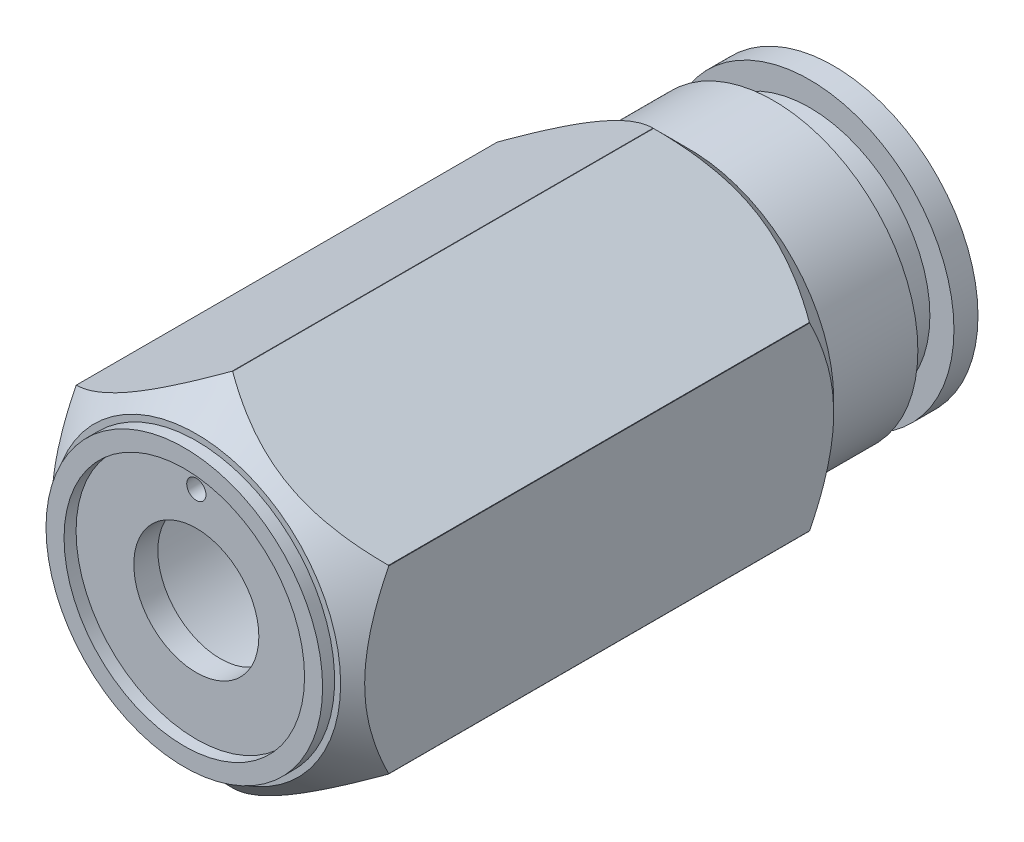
ISO-10303-21;
HEADER;
FILE_DESCRIPTION(('STEP AP214'),'2;1');
FILE_NAME('part.step','',(''),(''),'','','');
FILE_SCHEMA(('AUTOMOTIVE_DESIGN { 1 0 10303 214 1 1 1 1 }'));
ENDSEC;
DATA;
#1=APPLICATION_CONTEXT('core data for automotive mechanical design processes');
#2=APPLICATION_PROTOCOL_DEFINITION('international standard','automotive_design',2000,#1);
#3=PRODUCT_CONTEXT('',#1,'mechanical');
#4=PRODUCT('Part','Part','',(#3));
#5=PRODUCT_RELATED_PRODUCT_CATEGORY('part','',(#4));
#6=PRODUCT_DEFINITION_FORMATION('','',#4);
#7=PRODUCT_DEFINITION_CONTEXT('part definition',#1,'design');
#8=PRODUCT_DEFINITION('design','',#6,#7);
#9=PRODUCT_DEFINITION_SHAPE('','',#8);
#10=(LENGTH_UNIT() NAMED_UNIT(*) SI_UNIT(.MILLI.,.METRE.));
#11=(NAMED_UNIT(*) PLANE_ANGLE_UNIT() SI_UNIT($,.RADIAN.));
#12=(NAMED_UNIT(*) SI_UNIT($,.STERADIAN.) SOLID_ANGLE_UNIT());
#13=UNCERTAINTY_MEASURE_WITH_UNIT(LENGTH_MEASURE(1.E-05),#10,'distance_accuracy_value','');
#14=(GEOMETRIC_REPRESENTATION_CONTEXT(3) GLOBAL_UNCERTAINTY_ASSIGNED_CONTEXT((#13)) GLOBAL_UNIT_ASSIGNED_CONTEXT((#10,
#11,#12)) REPRESENTATION_CONTEXT('',''));
#15=CARTESIAN_POINT('',(0.,0.,0.));
#16=DIRECTION('',(0.,0.,1.));
#17=DIRECTION('',(1.,0.,0.));
#18=AXIS2_PLACEMENT_3D('',#15,#16,#17);
#19=CARTESIAN_POINT('',(0.,6.,-6.));
#20=DIRECTION('',(0.,0.,1.));
#21=DIRECTION('',(1.,0.,0.));
#22=AXIS2_PLACEMENT_3D('',#19,#20,#21);
#23=PLANE('',#22);
#24=CARTESIAN_POINT('',(0.,0.,-6.));
#25=DIRECTION('',(0.,0.,-1.));
#26=DIRECTION('',(-1.,0.,0.));
#27=AXIS2_PLACEMENT_3D('',#24,#25,#26);
#28=CIRCLE('',#27,2.5);
#29=CARTESIAN_POINT('',(-2.5,0.,-6.));
#30=VERTEX_POINT('',#29);
#31=EDGE_CURVE('E282',#30,#30,#28,.T.);
#32=ORIENTED_EDGE('',*,*,#31,.F.);
#33=EDGE_LOOP('',(#32));
#34=FACE_BOUND('',#33,.T.);
#35=CARTESIAN_POINT('',(0.,0.,-6.));
#36=DIRECTION('',(0.,0.,1.));
#37=DIRECTION('',(1.,0.,0.));
#38=AXIS2_PLACEMENT_3D('',#35,#36,#37);
#39=CIRCLE('',#38,6.);
#40=CARTESIAN_POINT('',(-6.,0.,-6.));
#41=VERTEX_POINT('',#40);
#42=EDGE_CURVE('E297',#41,#41,#39,.T.);
#43=ORIENTED_EDGE('',*,*,#42,.F.);
#44=EDGE_LOOP('',(#43));
#45=FACE_BOUND('',#44,.T.);
#46=ADVANCED_FACE('F16',(#34,#45),#23,.F.);
#47=CARTESIAN_POINT('',(0.,5.,-5.));
#48=DIRECTION('',(0.,0.,-1.));
#49=DIRECTION('',(0.,-1.,0.));
#50=AXIS2_PLACEMENT_3D('',#47,#48,#49);
#51=PLANE('',#50);
#52=CARTESIAN_POINT('',(0.,0.,-5.));
#53=DIRECTION('',(0.,0.,1.));
#54=DIRECTION('',(1.,0.,0.));
#55=AXIS2_PLACEMENT_3D('',#52,#53,#54);
#56=CIRCLE('',#55,5.);
#57=CARTESIAN_POINT('',(-5.,0.,-5.));
#58=VERTEX_POINT('',#57);
#59=EDGE_CURVE('E283',#58,#58,#56,.T.);
#60=ORIENTED_EDGE('',*,*,#59,.F.);
#61=EDGE_LOOP('',(#60));
#62=FACE_BOUND('',#61,.T.);
#63=CARTESIAN_POINT('',(0.,0.,-5.));
#64=DIRECTION('',(0.,0.,1.));
#65=DIRECTION('',(1.,0.,0.));
#66=AXIS2_PLACEMENT_3D('',#63,#64,#65);
#67=CIRCLE('',#66,6.);
#68=CARTESIAN_POINT('',(6.,0.,-5.));
#69=VERTEX_POINT('',#68);
#70=EDGE_CURVE('E286',#69,#69,#67,.T.);
#71=ORIENTED_EDGE('',*,*,#70,.T.);
#72=EDGE_LOOP('',(#71));
#73=FACE_BOUND('',#72,.T.);
#74=ADVANCED_FACE('F597',(#62,#73),#51,.F.);
#75=CARTESIAN_POINT('',(0.,6.,-3.5));
#76=DIRECTION('',(0.,0.,1.));
#77=DIRECTION('',(1.,0.,0.));
#78=AXIS2_PLACEMENT_3D('',#75,#76,#77);
#79=PLANE('',#78);
#80=CARTESIAN_POINT('',(0.,0.,-3.5));
#81=DIRECTION('',(0.,0.,1.));
#82=DIRECTION('',(1.,0.,0.));
#83=AXIS2_PLACEMENT_3D('',#80,#81,#82);
#84=CIRCLE('',#83,5.);
#85=CARTESIAN_POINT('',(5.,0.,-3.5));
#86=VERTEX_POINT('',#85);
#87=EDGE_CURVE('E252',#86,#86,#84,.T.);
#88=ORIENTED_EDGE('',*,*,#87,.T.);
#89=EDGE_LOOP('',(#88));
#90=FACE_BOUND('',#89,.T.);
#91=CARTESIAN_POINT('',(0.,0.,-3.5));
#92=DIRECTION('',(0.,0.,1.));
#93=DIRECTION('',(1.,0.,0.));
#94=AXIS2_PLACEMENT_3D('',#91,#92,#93);
#95=CIRCLE('',#94,6.);
#96=CARTESIAN_POINT('',(-6.,0.,-3.5));
#97=VERTEX_POINT('',#96);
#98=EDGE_CURVE('E242',#97,#97,#95,.T.);
#99=ORIENTED_EDGE('',*,*,#98,.F.);
#100=EDGE_LOOP('',(#99));
#101=FACE_BOUND('',#100,.T.);
#102=ADVANCED_FACE('F592',(#90,#101),#79,.F.);
#103=CARTESIAN_POINT('',(0.,-7.50555349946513,20.5));
#104=DIRECTION('',(0.5,0.866025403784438,0.));
#105=DIRECTION('',(0.,0.,-1.));
#106=AXIS2_PLACEMENT_3D('',#103,#104,#105);
#107=PLANE('',#106);
#108=CARTESIAN_POINT('',(-0.0096296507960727,-7.49999381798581,19.));
#109=CARTESIAN_POINT('',(-0.828912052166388,-7.02698090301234,19.4719606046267));
#110=CARTESIAN_POINT('',(-1.57034631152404,-6.59891363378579,19.7168113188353));
#111=CARTESIAN_POINT('',(-2.4215834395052,-6.10745164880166,19.9979232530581));
#112=CARTESIAN_POINT('',(-3.23817168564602,-5.63599420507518,19.9999856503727));
#113=CARTESIAN_POINT('',(-4.05526989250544,-5.16424233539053,20.002049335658));
#114=CARTESIAN_POINT('',(-4.90801836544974,-4.67190777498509,19.7239121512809));
#115=CARTESIAN_POINT('',(-5.65882494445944,-4.2384293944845,19.4790249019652));
#116=CARTESIAN_POINT('',(-6.49037034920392,-3.75833643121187,19.));
#117=B_SPLINE_CURVE_WITH_KNOTS('',2,(#108,#109,#110,#111,#112,#113,#114,#115,#116),
.UNSPECIFIED.,.F.,.F.,(3,2,2,2,3),(0.,0.25,0.5,0.75,1.),.UNSPECIFIED.);
#118=CARTESIAN_POINT('',(-0.0096296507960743,-7.49999381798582,19.));
#119=VERTEX_POINT('',#118);
#120=CARTESIAN_POINT('',(-6.49037034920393,-3.75833643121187,19.));
#121=VERTEX_POINT('',#120);
#122=EDGE_CURVE('E478',#119,#121,#117,.T.);
#123=ORIENTED_EDGE('',*,*,#122,.T.);
#124=DIRECTION('',(0.,0.,1.));
#125=VECTOR('',#124,1.);
#126=CARTESIAN_POINT('',(-6.49037034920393,-3.75833643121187,20.5));
#127=LINE('',#126,#125);
#128=CARTESIAN_POINT('',(-6.49037034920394,-3.75833643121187,1.5));
#129=VERTEX_POINT('',#128);
#130=EDGE_CURVE('E10',#129,#121,#127,.T.);
#131=ORIENTED_EDGE('',*,*,#130,.F.);
#132=CARTESIAN_POINT('',(-6.49037034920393,-3.75833643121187,1.5));
#133=CARTESIAN_POINT('',(-5.67108794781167,-4.23134934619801,1.0280393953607));
#134=CARTESIAN_POINT('',(-4.92965368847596,-4.6594166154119,0.783188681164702));
#135=CARTESIAN_POINT('',(-4.078416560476,-5.15087860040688,0.502076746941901));
#136=CARTESIAN_POINT('',(-3.26182831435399,-5.62233604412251,0.500014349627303));
#137=CARTESIAN_POINT('',(-2.4447301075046,-6.09408791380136,0.497950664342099));
#138=CARTESIAN_POINT('',(-1.59198163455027,-6.58642247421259,0.776087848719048));
#139=CARTESIAN_POINT('',(-0.841175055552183,-7.01990085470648,1.02097509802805));
#140=CARTESIAN_POINT('',(-0.00962965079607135,-7.49999381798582,1.5));
#141=B_SPLINE_CURVE_WITH_KNOTS('',2,(#132,#133,#134,#135,#136,#137,#138,#139,#140),
.UNSPECIFIED.,.F.,.F.,(3,2,2,2,3),(0.,0.25,0.5,0.75,1.),.UNSPECIFIED.);
#142=CARTESIAN_POINT('',(-0.00962965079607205,-7.49999381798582,1.5));
#143=VERTEX_POINT('',#142);
#144=EDGE_CURVE('E534',#129,#143,#141,.T.);
#145=ORIENTED_EDGE('',*,*,#144,.T.);
#146=DIRECTION('',(0.,0.,-1.));
#147=VECTOR('',#146,1.);
#148=CARTESIAN_POINT('',(-0.0096296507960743,-7.49999381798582,20.5));
#149=LINE('',#148,#147);
#150=EDGE_CURVE('E304',#119,#143,#149,.T.);
#151=ORIENTED_EDGE('',*,*,#150,.F.);
#152=EDGE_LOOP('',(#123,#131,#145,#151));
#153=FACE_BOUND('',#152,.T.);
#154=ADVANCED_FACE('F596',(#153),#107,.F.);
#155=CARTESIAN_POINT('',(0.,0.,20.5));
#156=DIRECTION('',(0.,0.,-1.));
#157=DIRECTION('',(-1.,0.,0.));
#158=AXIS2_PLACEMENT_3D('',#155,#156,#157);
#159=CYLINDRICAL_SURFACE('',#158,7.5);
#160=CARTESIAN_POINT('',(0.,0.,1.5));
#161=DIRECTION('',(0.,0.,1.));
#162=DIRECTION('',(1.,0.,0.));
#163=AXIS2_PLACEMENT_3D('',#160,#161,#162);
#164=CIRCLE('',#163,7.5);
#165=CARTESIAN_POINT('',(-6.5,-3.74165738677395,1.5));
#166=VERTEX_POINT('',#165);
#167=EDGE_CURVE('E538',#166,#129,#164,.T.);
#168=ORIENTED_EDGE('',*,*,#167,.T.);
#169=ORIENTED_EDGE('',*,*,#130,.T.);
#170=CARTESIAN_POINT('',(0.,0.,19.));
#171=DIRECTION('',(0.,0.,-1.));
#172=DIRECTION('',(1.,0.,0.));
#173=AXIS2_PLACEMENT_3D('',#170,#171,#172);
#174=CIRCLE('',#173,7.5);
#175=CARTESIAN_POINT('',(-6.5,-3.74165738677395,19.));
#176=VERTEX_POINT('',#175);
#177=EDGE_CURVE('E482',#121,#176,#174,.T.);
#178=ORIENTED_EDGE('',*,*,#177,.T.);
#179=DIRECTION('',(0.,0.,-1.));
#180=VECTOR('',#179,1.);
#181=CARTESIAN_POINT('',(-6.5,-3.74165738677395,20.5));
#182=LINE('',#181,#180);
#183=EDGE_CURVE('E29',#176,#166,#182,.T.);
#184=ORIENTED_EDGE('',*,*,#183,.T.);
#185=EDGE_LOOP('',(#168,#169,#178,#184));
#186=FACE_BOUND('',#185,.T.);
#187=ADVANCED_FACE('F639',(#186),#159,.T.);
#188=CARTESIAN_POINT('',(-6.5,-3.75277674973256,20.5));
#189=DIRECTION('',(1.,0.,0.));
#190=DIRECTION('',(0.,1.,0.));
#191=AXIS2_PLACEMENT_3D('',#188,#189,#190);
#192=PLANE('',#191);
#193=CARTESIAN_POINT('',(-6.5,-3.74165738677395,19.));
#194=CARTESIAN_POINT('',(-6.5,-2.78837203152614,19.4755822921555));
#195=CARTESIAN_POINT('',(-6.5,-1.92613583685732,19.7206195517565));
#196=CARTESIAN_POINT('',(-6.5,-0.943052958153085,20.));
#197=CARTESIAN_POINT('',(-6.5,0.,20.));
#198=B_SPLINE_CURVE_WITH_KNOTS('',2,(#193,#194,#195,#196,#197),.UNSPECIFIED.,.F.,.F.,(3,2,3),
(0.,0.5,1.),.UNSPECIFIED.);
#199=CARTESIAN_POINT('',(-6.5,0.,20.));
#200=VERTEX_POINT('',#199);
#201=EDGE_CURVE('E1085',#176,#200,#198,.T.);
#202=ORIENTED_EDGE('',*,*,#201,.T.);
#203=CARTESIAN_POINT('',(-6.5,0.,20.));
#204=CARTESIAN_POINT('',(-6.5,0.942559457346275,20.));
#205=CARTESIAN_POINT('',(-6.5,1.92613782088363,19.7206189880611));
#206=CARTESIAN_POINT('',(-6.5,2.78779977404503,19.4758677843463));
#207=CARTESIAN_POINT('',(-6.5,3.74165738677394,19.));
#208=B_SPLINE_CURVE_WITH_KNOTS('',2,(#203,#204,#205,#206,#207),.UNSPECIFIED.,.F.,.F.,(3,2,3),
(0.,0.5,1.),.UNSPECIFIED.);
#209=CARTESIAN_POINT('',(-6.5,3.74165738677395,19.));
#210=VERTEX_POINT('',#209);
#211=EDGE_CURVE('E275',#200,#210,#208,.T.);
#212=ORIENTED_EDGE('',*,*,#211,.T.);
#213=DIRECTION('',(0.,0.,1.));
#214=VECTOR('',#213,1.);
#215=CARTESIAN_POINT('',(-6.5,3.74165738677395,20.5));
#216=LINE('',#215,#214);
#217=CARTESIAN_POINT('',(-6.5,3.74165738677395,1.5));
#218=VERTEX_POINT('',#217);
#219=EDGE_CURVE('E490',#218,#210,#216,.T.);
#220=ORIENTED_EDGE('',*,*,#219,.F.);
#221=CARTESIAN_POINT('',(-6.5,3.74165738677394,1.5));
#222=CARTESIAN_POINT('',(-6.5,2.78837517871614,1.0244192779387));
#223=CARTESIAN_POINT('',(-6.5,1.92613782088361,0.779381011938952));
#224=CARTESIAN_POINT('',(-6.5,0.943055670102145,0.5));
#225=CARTESIAN_POINT('',(-6.5,0.,0.5));
#226=B_SPLINE_CURVE_WITH_KNOTS('',2,(#221,#222,#223,#224,#225),.UNSPECIFIED.,.F.,.F.,(3,2,3),
(0.,0.5,1.),.UNSPECIFIED.);
#227=CARTESIAN_POINT('',(-6.5,0.,0.5));
#228=VERTEX_POINT('',#227);
#229=EDGE_CURVE('E544',#218,#228,#226,.T.);
#230=ORIENTED_EDGE('',*,*,#229,.T.);
#231=CARTESIAN_POINT('',(-6.5,0.,0.5));
#232=CARTESIAN_POINT('',(-6.5,-0.942560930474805,0.5));
#233=CARTESIAN_POINT('',(-6.5,-1.92613583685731,0.779380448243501));
#234=CARTESIAN_POINT('',(-6.5,-2.78780147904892,1.024133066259));
#235=CARTESIAN_POINT('',(-6.5,-3.74165738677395,1.5));
#236=B_SPLINE_CURVE_WITH_KNOTS('',2,(#231,#232,#233,#234,#235),.UNSPECIFIED.,.F.,.F.,(3,2,3),
(0.,0.5,1.),.UNSPECIFIED.);
#237=EDGE_CURVE('E1051',#228,#166,#236,.T.);
#238=ORIENTED_EDGE('',*,*,#237,.T.);
#239=ORIENTED_EDGE('',*,*,#183,.F.);
#240=EDGE_LOOP('',(#202,#212,#220,#230,#238,#239));
#241=FACE_BOUND('',#240,.T.);
#242=ADVANCED_FACE('F643',(#241),#192,.F.);
#243=CARTESIAN_POINT('',(0.,0.,20.5));
#244=DIRECTION('',(0.,0.,-1.));
#245=DIRECTION('',(-1.,0.,0.));
#246=AXIS2_PLACEMENT_3D('',#243,#244,#245);
#247=CYLINDRICAL_SURFACE('',#246,7.5);
#248=CARTESIAN_POINT('',(0.,0.,19.));
#249=DIRECTION('',(0.,0.,-1.));
#250=DIRECTION('',(1.,0.,0.));
#251=AXIS2_PLACEMENT_3D('',#248,#249,#250);
#252=CIRCLE('',#251,7.5);
#253=CARTESIAN_POINT('',(-6.49037034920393,3.75833643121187,19.));
#254=VERTEX_POINT('',#253);
#255=EDGE_CURVE('E294',#210,#254,#252,.T.);
#256=ORIENTED_EDGE('',*,*,#255,.T.);
#257=DIRECTION('',(0.,0.,-1.));
#258=VECTOR('',#257,1.);
#259=CARTESIAN_POINT('',(-6.49037034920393,3.75833643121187,20.5));
#260=LINE('',#259,#258);
#261=CARTESIAN_POINT('',(-6.49037034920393,3.75833643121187,1.5));
#262=VERTEX_POINT('',#261);
#263=EDGE_CURVE('E193',#254,#262,#260,.T.);
#264=ORIENTED_EDGE('',*,*,#263,.T.);
#265=CARTESIAN_POINT('',(0.,0.,1.5));
#266=DIRECTION('',(0.,0.,1.));
#267=DIRECTION('',(1.,0.,0.));
#268=AXIS2_PLACEMENT_3D('',#265,#266,#267);
#269=CIRCLE('',#268,7.5);
#270=EDGE_CURVE('E351',#262,#218,#269,.T.);
#271=ORIENTED_EDGE('',*,*,#270,.T.);
#272=ORIENTED_EDGE('',*,*,#219,.T.);
#273=EDGE_LOOP('',(#256,#264,#271,#272));
#274=FACE_BOUND('',#273,.T.);
#275=ADVANCED_FACE('F18',(#274),#247,.T.);
#276=CARTESIAN_POINT('',(-6.5,3.75277674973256,20.5));
#277=DIRECTION('',(0.5,-0.866025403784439,0.));
#278=DIRECTION('',(0.,0.,-1.));
#279=AXIS2_PLACEMENT_3D('',#276,#277,#278);
#280=PLANE('',#279);
#281=CARTESIAN_POINT('',(-6.49037034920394,3.75833643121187,19.));
#282=CARTESIAN_POINT('',(-5.67108794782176,4.2313493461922,19.4719606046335));
#283=CARTESIAN_POINT('',(-4.92965368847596,4.6594166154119,19.7168113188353));
#284=CARTESIAN_POINT('',(-4.07841656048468,5.15087860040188,19.9979232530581));
#285=CARTESIAN_POINT('',(-3.26182831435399,5.62233604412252,19.9999856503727));
#286=CARTESIAN_POINT('',(-2.44473010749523,6.09408791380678,20.0020493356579));
#287=CARTESIAN_POINT('',(-1.59198163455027,6.58642247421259,19.7239121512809));
#288=CARTESIAN_POINT('',(-0.841175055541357,7.01990085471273,19.4790249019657));
#289=CARTESIAN_POINT('',(-0.00962965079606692,7.49999381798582,19.));
#290=B_SPLINE_CURVE_WITH_KNOTS('',2,(#281,#282,#283,#284,#285,#286,#287,#288,#289),
.UNSPECIFIED.,.F.,.F.,(3,2,2,2,3),(0.,0.25,0.5,0.75,1.),.UNSPECIFIED.);
#291=CARTESIAN_POINT('',(-0.00962965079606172,7.49999381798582,19.));
#292=VERTEX_POINT('',#291);
#293=EDGE_CURVE('E309',#254,#292,#290,.T.);
#294=ORIENTED_EDGE('',*,*,#293,.T.);
#295=DIRECTION('',(0.,0.,1.));
#296=VECTOR('',#295,1.);
#297=CARTESIAN_POINT('',(-0.00962965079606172,7.49999381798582,20.5));
#298=LINE('',#297,#296);
#299=CARTESIAN_POINT('',(-0.00962965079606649,7.49999381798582,1.5));
#300=VERTEX_POINT('',#299);
#301=EDGE_CURVE('E182',#300,#292,#298,.T.);
#302=ORIENTED_EDGE('',*,*,#301,.F.);
#303=CARTESIAN_POINT('',(-0.00962965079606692,7.49999381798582,1.5));
#304=CARTESIAN_POINT('',(-0.828912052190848,7.02698090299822,1.02803939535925));
#305=CARTESIAN_POINT('',(-1.57034631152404,6.59891363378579,0.783188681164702));
#306=CARTESIAN_POINT('',(-2.42158343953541,6.10745164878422,0.502076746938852));
#307=CARTESIAN_POINT('',(-3.23817168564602,5.63599420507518,0.500014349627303));
#308=CARTESIAN_POINT('',(-4.05526989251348,5.16424233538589,0.497950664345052));
#309=CARTESIAN_POINT('',(-4.90801836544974,4.6719077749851,0.776087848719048));
#310=CARTESIAN_POINT('',(-5.6588249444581,4.23842939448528,1.020975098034));
#311=CARTESIAN_POINT('',(-6.49037034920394,3.75833643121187,1.5));
#312=B_SPLINE_CURVE_WITH_KNOTS('',2,(#303,#304,#305,#306,#307,#308,#309,#310,#311),
.UNSPECIFIED.,.F.,.F.,(3,2,2,2,3),(0.,0.25,0.5,0.75,1.),.UNSPECIFIED.);
#313=EDGE_CURVE('E347',#300,#262,#312,.T.);
#314=ORIENTED_EDGE('',*,*,#313,.T.);
#315=ORIENTED_EDGE('',*,*,#263,.F.);
#316=EDGE_LOOP('',(#294,#302,#314,#315));
#317=FACE_BOUND('',#316,.T.);
#318=ADVANCED_FACE('F316',(#317),#280,.F.);
#319=CARTESIAN_POINT('',(0.,0.,20.5));
#320=DIRECTION('',(0.,0.,-1.));
#321=DIRECTION('',(-1.,0.,0.));
#322=AXIS2_PLACEMENT_3D('',#319,#320,#321);
#323=CYLINDRICAL_SURFACE('',#322,7.5);
#324=CARTESIAN_POINT('',(0.,0.,19.));
#325=DIRECTION('',(0.,0.,-1.));
#326=DIRECTION('',(1.,4.06785716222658E-13,0.));
#327=AXIS2_PLACEMENT_3D('',#324,#325,#326);
#328=CIRCLE('',#327,7.5);
#329=CARTESIAN_POINT('',(0.00962965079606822,7.49999381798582,19.));
#330=VERTEX_POINT('',#329);
#331=EDGE_CURVE('E1075',#292,#330,#328,.T.);
#332=ORIENTED_EDGE('',*,*,#331,.T.);
#333=DIRECTION('',(0.,0.,-1.));
#334=VECTOR('',#333,1.);
#335=CARTESIAN_POINT('',(0.00962965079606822,7.49999381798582,20.5));
#336=LINE('',#335,#334);
#337=CARTESIAN_POINT('',(0.00962965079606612,7.49999381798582,1.5));
#338=VERTEX_POINT('',#337);
#339=EDGE_CURVE('E498',#330,#338,#336,.T.);
#340=ORIENTED_EDGE('',*,*,#339,.T.);
#341=CARTESIAN_POINT('',(0.,0.,1.5));
#342=DIRECTION('',(0.,0.,1.));
#343=DIRECTION('',(1.,0.,0.));
#344=AXIS2_PLACEMENT_3D('',#341,#342,#343);
#345=CIRCLE('',#344,7.5);
#346=EDGE_CURVE('E508',#338,#300,#345,.T.);
#347=ORIENTED_EDGE('',*,*,#346,.T.);
#348=ORIENTED_EDGE('',*,*,#301,.T.);
#349=EDGE_LOOP('',(#332,#340,#347,#348));
#350=FACE_BOUND('',#349,.T.);
#351=ADVANCED_FACE('F326',(#350),#323,.T.);
#352=CARTESIAN_POINT('',(0.,7.50555349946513,20.5));
#353=DIRECTION('',(-0.5,-0.866025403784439,0.));
#354=DIRECTION('',(-0.866025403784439,0.5,0.));
#355=AXIS2_PLACEMENT_3D('',#352,#353,#354);
#356=PLANE('',#355);
#357=CARTESIAN_POINT('',(0.00962965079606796,7.49999381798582,19.));
#358=CARTESIAN_POINT('',(0.828912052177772,7.02698090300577,19.4719606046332));
#359=CARTESIAN_POINT('',(1.57034631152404,6.59891363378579,19.7168113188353));
#360=CARTESIAN_POINT('',(2.42158343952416,6.10745164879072,19.9979232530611));
#361=CARTESIAN_POINT('',(3.23817168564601,5.63599420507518,19.9999856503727));
#362=CARTESIAN_POINT('',(4.0552698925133,5.16424233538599,20.0020493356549));
#363=CARTESIAN_POINT('',(4.90801836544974,4.67190777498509,19.7239121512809));
#364=CARTESIAN_POINT('',(5.65882494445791,4.23842939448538,19.4790249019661));
#365=CARTESIAN_POINT('',(6.49037034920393,3.75833643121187,19.));
#366=B_SPLINE_CURVE_WITH_KNOTS('',2,(#357,#358,#359,#360,#361,#362,#363,#364,#365),
.UNSPECIFIED.,.F.,.F.,(3,2,2,2,3),(0.,0.25,0.5,0.75,1.),.UNSPECIFIED.);
#367=CARTESIAN_POINT('',(6.49037034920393,3.75833643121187,19.));
#368=VERTEX_POINT('',#367);
#369=EDGE_CURVE('E1072',#330,#368,#366,.T.);
#370=ORIENTED_EDGE('',*,*,#369,.T.);
#371=DIRECTION('',(0.,0.,1.));
#372=VECTOR('',#371,1.);
#373=CARTESIAN_POINT('',(6.49037034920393,3.75833643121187,20.5));
#374=LINE('',#373,#372);
#375=CARTESIAN_POINT('',(6.49037034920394,3.75833643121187,1.5));
#376=VERTEX_POINT('',#375);
#377=EDGE_CURVE('E500',#376,#368,#374,.T.);
#378=ORIENTED_EDGE('',*,*,#377,.F.);
#379=CARTESIAN_POINT('',(6.49037034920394,3.75833643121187,1.49999999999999));
#380=CARTESIAN_POINT('',(5.67108794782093,4.23134934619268,1.02803939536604));
#381=CARTESIAN_POINT('',(4.92965368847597,4.6594166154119,0.783188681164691));
#382=CARTESIAN_POINT('',(4.07841656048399,5.15087860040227,0.502076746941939));
#383=CARTESIAN_POINT('',(3.26182831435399,5.62233604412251,0.500014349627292));
#384=CARTESIAN_POINT('',(2.44473010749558,6.09408791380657,0.49795066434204));
#385=CARTESIAN_POINT('',(1.59198163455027,6.58642247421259,0.776087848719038));
#386=CARTESIAN_POINT('',(0.841175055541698,7.01990085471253,1.0209750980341));
#387=CARTESIAN_POINT('',(0.00962965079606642,7.49999381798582,1.49999999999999));
#388=B_SPLINE_CURVE_WITH_KNOTS('',2,(#379,#380,#381,#382,#383,#384,#385,#386,#387),
.UNSPECIFIED.,.F.,.F.,(3,2,2,2,3),(0.,0.25,0.5,0.75,1.),.UNSPECIFIED.);
#389=EDGE_CURVE('E510',#376,#338,#388,.T.);
#390=ORIENTED_EDGE('',*,*,#389,.T.);
#391=ORIENTED_EDGE('',*,*,#339,.F.);
#392=EDGE_LOOP('',(#370,#378,#390,#391));
#393=FACE_BOUND('',#392,.T.);
#394=ADVANCED_FACE('F673',(#393),#356,.F.);
#395=CARTESIAN_POINT('',(0.,0.,20.5));
#396=DIRECTION('',(0.,0.,-1.));
#397=DIRECTION('',(-1.,0.,0.));
#398=AXIS2_PLACEMENT_3D('',#395,#396,#397);
#399=CYLINDRICAL_SURFACE('',#398,7.5);
#400=CARTESIAN_POINT('',(0.,0.,19.));
#401=DIRECTION('',(0.,0.,-1.));
#402=DIRECTION('',(1.,4.9826809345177E-13,0.));
#403=AXIS2_PLACEMENT_3D('',#400,#401,#402);
#404=CIRCLE('',#403,7.5);
#405=CARTESIAN_POINT('',(6.5,3.74165738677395,19.));
#406=VERTEX_POINT('',#405);
#407=EDGE_CURVE('E1076',#368,#406,#404,.T.);
#408=ORIENTED_EDGE('',*,*,#407,.T.);
#409=DIRECTION('',(0.,0.,-1.));
#410=VECTOR('',#409,1.);
#411=CARTESIAN_POINT('',(6.5,3.74165738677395,20.5));
#412=LINE('',#411,#410);
#413=CARTESIAN_POINT('',(6.5,3.74165738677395,1.5));
#414=VERTEX_POINT('',#413);
#415=EDGE_CURVE('E988',#406,#414,#412,.T.);
#416=ORIENTED_EDGE('',*,*,#415,.T.);
#417=CARTESIAN_POINT('',(0.,0.,1.5));
#418=DIRECTION('',(0.,0.,1.));
#419=DIRECTION('',(1.,0.,0.));
#420=AXIS2_PLACEMENT_3D('',#417,#418,#419);
#421=CIRCLE('',#420,7.5);
#422=EDGE_CURVE('E276',#414,#376,#421,.T.);
#423=ORIENTED_EDGE('',*,*,#422,.T.);
#424=ORIENTED_EDGE('',*,*,#377,.T.);
#425=EDGE_LOOP('',(#408,#416,#423,#424));
#426=FACE_BOUND('',#425,.T.);
#427=ADVANCED_FACE('F424',(#426),#399,.T.);
#428=CARTESIAN_POINT('',(6.5,3.75277674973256,20.5));
#429=DIRECTION('',(-1.,0.,0.));
#430=DIRECTION('',(0.,0.,1.));
#431=AXIS2_PLACEMENT_3D('',#428,#429,#430);
#432=PLANE('',#431);
#433=CARTESIAN_POINT('',(6.5,3.74165738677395,19.));
#434=CARTESIAN_POINT('',(6.5,2.78837517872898,19.4755807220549));
#435=CARTESIAN_POINT('',(6.5,1.92613782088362,19.7206189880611));
#436=CARTESIAN_POINT('',(6.5,0.943055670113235,20.));
#437=CARTESIAN_POINT('',(6.5,0.,20.));
#438=B_SPLINE_CURVE_WITH_KNOTS('',2,(#433,#434,#435,#436,#437),.UNSPECIFIED.,.F.,.F.,(3,2,3),
(0.,0.5,1.),.UNSPECIFIED.);
#439=CARTESIAN_POINT('',(6.5,0.,20.));
#440=VERTEX_POINT('',#439);
#441=EDGE_CURVE('E994',#406,#440,#438,.T.);
#442=ORIENTED_EDGE('',*,*,#441,.T.);
#443=CARTESIAN_POINT('',(6.5,0.,20.));
#444=CARTESIAN_POINT('',(6.5,-0.942560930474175,20.));
#445=CARTESIAN_POINT('',(6.5,-1.92613583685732,19.7206195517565));
#446=CARTESIAN_POINT('',(6.5,-2.78780147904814,19.4758669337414));
#447=CARTESIAN_POINT('',(6.5,-3.74165738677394,19.));
#448=B_SPLINE_CURVE_WITH_KNOTS('',2,(#443,#444,#445,#446,#447),.UNSPECIFIED.,.F.,.F.,(3,2,3),
(0.,0.5,1.),.UNSPECIFIED.);
#449=CARTESIAN_POINT('',(6.5,-3.74165738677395,19.));
#450=VERTEX_POINT('',#449);
#451=EDGE_CURVE('E992',#440,#450,#448,.T.);
#452=ORIENTED_EDGE('',*,*,#451,.T.);
#453=DIRECTION('',(0.,0.,1.));
#454=VECTOR('',#453,1.);
#455=CARTESIAN_POINT('',(6.5,-3.74165738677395,20.5));
#456=LINE('',#455,#454);
#457=CARTESIAN_POINT('',(6.5,-3.74165738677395,1.5));
#458=VERTEX_POINT('',#457);
#459=EDGE_CURVE('E982',#458,#450,#456,.T.);
#460=ORIENTED_EDGE('',*,*,#459,.F.);
#461=CARTESIAN_POINT('',(6.5,-3.74165738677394,1.5));
#462=CARTESIAN_POINT('',(6.5,-2.78837203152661,1.0244177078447));
#463=CARTESIAN_POINT('',(6.5,-1.92613583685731,0.779380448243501));
#464=CARTESIAN_POINT('',(6.5,-0.943052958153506,0.5));
#465=CARTESIAN_POINT('',(6.5,0.,0.5));
#466=B_SPLINE_CURVE_WITH_KNOTS('',2,(#461,#462,#463,#464,#465),.UNSPECIFIED.,.F.,.F.,(3,2,3),
(0.,0.5,1.),.UNSPECIFIED.);
#467=CARTESIAN_POINT('',(6.5,0.,0.5));
#468=VERTEX_POINT('',#467);
#469=EDGE_CURVE('E250',#458,#468,#466,.T.);
#470=ORIENTED_EDGE('',*,*,#469,.T.);
#471=CARTESIAN_POINT('',(6.5,0.,0.5));
#472=CARTESIAN_POINT('',(6.5,0.942559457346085,0.5));
#473=CARTESIAN_POINT('',(6.5,1.92613782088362,0.779381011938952));
#474=CARTESIAN_POINT('',(6.5,2.78779977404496,1.0241322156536));
#475=CARTESIAN_POINT('',(6.5,3.74165738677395,1.5));
#476=B_SPLINE_CURVE_WITH_KNOTS('',2,(#471,#472,#473,#474,#475),.UNSPECIFIED.,.F.,.F.,(3,2,3),
(0.,0.5,1.),.UNSPECIFIED.);
#477=EDGE_CURVE('E241',#468,#414,#476,.T.);
#478=ORIENTED_EDGE('',*,*,#477,.T.);
#479=ORIENTED_EDGE('',*,*,#415,.F.);
#480=EDGE_LOOP('',(#442,#452,#460,#470,#478,#479));
#481=FACE_BOUND('',#480,.T.);
#482=ADVANCED_FACE('F414',(#481),#432,.F.);
#483=CARTESIAN_POINT('',(0.,0.,20.5));
#484=DIRECTION('',(0.,0.,-1.));
#485=DIRECTION('',(-1.,0.,0.));
#486=AXIS2_PLACEMENT_3D('',#483,#484,#485);
#487=CYLINDRICAL_SURFACE('',#486,7.5);
#488=CARTESIAN_POINT('',(0.,0.,19.));
#489=DIRECTION('',(0.,0.,-1.));
#490=DIRECTION('',(1.,0.,0.));
#491=AXIS2_PLACEMENT_3D('',#488,#489,#490);
#492=CIRCLE('',#491,7.5);
#493=CARTESIAN_POINT('',(6.49037034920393,-3.75833643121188,19.));
#494=VERTEX_POINT('',#493);
#495=EDGE_CURVE('E985',#450,#494,#492,.T.);
#496=ORIENTED_EDGE('',*,*,#495,.T.);
#497=DIRECTION('',(0.,0.,-1.));
#498=VECTOR('',#497,1.);
#499=CARTESIAN_POINT('',(6.49037034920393,-3.75833643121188,20.5));
#500=LINE('',#499,#498);
#501=CARTESIAN_POINT('',(6.49037034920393,-3.75833643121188,1.5));
#502=VERTEX_POINT('',#501);
#503=EDGE_CURVE('E989',#494,#502,#500,.T.);
#504=ORIENTED_EDGE('',*,*,#503,.T.);
#505=CARTESIAN_POINT('',(0.,0.,1.5));
#506=DIRECTION('',(0.,0.,1.));
#507=DIRECTION('',(1.,0.,0.));
#508=AXIS2_PLACEMENT_3D('',#505,#506,#507);
#509=CIRCLE('',#508,7.5);
#510=EDGE_CURVE('E450',#502,#458,#509,.T.);
#511=ORIENTED_EDGE('',*,*,#510,.T.);
#512=ORIENTED_EDGE('',*,*,#459,.T.);
#513=EDGE_LOOP('',(#496,#504,#511,#512));
#514=FACE_BOUND('',#513,.T.);
#515=ADVANCED_FACE('F423',(#514),#487,.T.);
#516=CARTESIAN_POINT('',(6.5,-3.75277674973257,20.5));
#517=DIRECTION('',(-0.5,0.866025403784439,0.));
#518=DIRECTION('',(0.,0.,1.));
#519=AXIS2_PLACEMENT_3D('',#516,#517,#518);
#520=PLANE('',#519);
#521=CARTESIAN_POINT('',(6.49037034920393,-3.75833643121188,19.));
#522=CARTESIAN_POINT('',(5.67108794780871,-4.23134934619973,19.471960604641));
#523=CARTESIAN_POINT('',(4.92965368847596,-4.65941661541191,19.7168113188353));
#524=CARTESIAN_POINT('',(4.07841656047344,-5.15087860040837,19.9979232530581));
#525=CARTESIAN_POINT('',(3.26182831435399,-5.62233604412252,19.9999856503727));
#526=CARTESIAN_POINT('',(2.44473010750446,-6.09408791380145,20.0020493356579));
#527=CARTESIAN_POINT('',(1.59198163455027,-6.5864224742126,19.7239121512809));
#528=CARTESIAN_POINT('',(0.841175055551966,-7.01990085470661,19.4790249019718));
#529=CARTESIAN_POINT('',(0.00962965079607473,-7.49999381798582,19.));
#530=B_SPLINE_CURVE_WITH_KNOTS('',2,(#521,#522,#523,#524,#525,#526,#527,#528,#529),
.UNSPECIFIED.,.F.,.F.,(3,2,2,2,3),(0.,0.25,0.5,0.75,1.),.UNSPECIFIED.);
#531=CARTESIAN_POINT('',(0.00962965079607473,-7.49999381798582,19.));
#532=VERTEX_POINT('',#531);
#533=EDGE_CURVE('E523',#494,#532,#530,.T.);
#534=ORIENTED_EDGE('',*,*,#533,.T.);
#535=DIRECTION('',(0.,0.,1.));
#536=VECTOR('',#535,1.);
#537=CARTESIAN_POINT('',(0.00962965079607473,-7.49999381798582,20.5));
#538=LINE('',#537,#536);
#539=CARTESIAN_POINT('',(0.00962965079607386,-7.49999381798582,1.5));
#540=VERTEX_POINT('',#539);
#541=EDGE_CURVE('E1037',#540,#532,#538,.T.);
#542=ORIENTED_EDGE('',*,*,#541,.F.);
#543=CARTESIAN_POINT('',(0.00962965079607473,-7.49999381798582,1.5));
#544=CARTESIAN_POINT('',(0.828912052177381,-7.026980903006,1.028039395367));
#545=CARTESIAN_POINT('',(1.57034631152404,-6.59891363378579,0.783188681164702));
#546=CARTESIAN_POINT('',(2.42158343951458,-6.10745164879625,0.50207674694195));
#547=CARTESIAN_POINT('',(3.23817168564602,-5.63599420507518,0.500014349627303));
#548=CARTESIAN_POINT('',(4.05526989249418,-5.16424233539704,0.497950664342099));
#549=CARTESIAN_POINT('',(4.90801836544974,-4.67190777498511,0.776087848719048));
#550=CARTESIAN_POINT('',(5.6588249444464,-4.23842939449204,1.02097509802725));
#551=CARTESIAN_POINT('',(6.49037034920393,-3.75833643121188,1.5));
#552=B_SPLINE_CURVE_WITH_KNOTS('',2,(#543,#544,#545,#546,#547,#548,#549,#550,#551),
.UNSPECIFIED.,.F.,.F.,(3,2,2,2,3),(0.,0.25,0.5,0.75,1.),.UNSPECIFIED.);
#553=EDGE_CURVE('E453',#540,#502,#552,.T.);
#554=ORIENTED_EDGE('',*,*,#553,.T.);
#555=ORIENTED_EDGE('',*,*,#503,.F.);
#556=EDGE_LOOP('',(#534,#542,#554,#555));
#557=FACE_BOUND('',#556,.T.);
#558=ADVANCED_FACE('F630',(#557),#520,.F.);
#559=CARTESIAN_POINT('',(0.,0.,20.5));
#560=DIRECTION('',(0.,0.,-1.));
#561=DIRECTION('',(-1.,0.,0.));
#562=AXIS2_PLACEMENT_3D('',#559,#560,#561);
#563=CYLINDRICAL_SURFACE('',#562,7.5);
#564=CARTESIAN_POINT('',(0.,0.,19.));
#565=DIRECTION('',(0.,0.,-1.));
#566=DIRECTION('',(1.,0.,0.));
#567=AXIS2_PLACEMENT_3D('',#564,#565,#566);
#568=CIRCLE('',#567,7.5);
#569=EDGE_CURVE('E481',#532,#119,#568,.T.);
#570=ORIENTED_EDGE('',*,*,#569,.T.);
#571=ORIENTED_EDGE('',*,*,#150,.T.);
#572=CARTESIAN_POINT('',(0.,0.,1.5));
#573=DIRECTION('',(0.,0.,1.));
#574=DIRECTION('',(1.,0.,0.));
#575=AXIS2_PLACEMENT_3D('',#572,#573,#574);
#576=CIRCLE('',#575,7.5);
#577=EDGE_CURVE('E461',#143,#540,#576,.T.);
#578=ORIENTED_EDGE('',*,*,#577,.T.);
#579=ORIENTED_EDGE('',*,*,#541,.T.);
#580=EDGE_LOOP('',(#570,#571,#578,#579));
#581=FACE_BOUND('',#580,.T.);
#582=ADVANCED_FACE('F587',(#581),#563,.T.);
#583=CARTESIAN_POINT('',(0.,0.,8.5));
#584=DIRECTION('',(0.,0.,1.));
#585=DIRECTION('',(1.,0.,0.));
#586=AXIS2_PLACEMENT_3D('',#583,#584,#585);
#587=PLANE('',#586);
#588=CARTESIAN_POINT('',(0.,0.,8.5));
#589=DIRECTION('',(0.,0.,-1.));
#590=DIRECTION('',(1.,0.,0.));
#591=AXIS2_PLACEMENT_3D('',#588,#589,#590);
#592=CIRCLE('',#591,2.5);
#593=CARTESIAN_POINT('',(-2.5,0.,8.5));
#594=VERTEX_POINT('',#593);
#595=EDGE_CURVE('E279',#594,#594,#592,.T.);
#596=ORIENTED_EDGE('',*,*,#595,.T.);
#597=EDGE_LOOP('',(#596));
#598=FACE_BOUND('',#597,.T.);
#599=CARTESIAN_POINT('',(0.,0.,8.5));
#600=DIRECTION('',(0.,0.,1.));
#601=DIRECTION('',(1.,0.,0.));
#602=AXIS2_PLACEMENT_3D('',#599,#600,#601);
#603=CIRCLE('',#602,5.);
#604=CARTESIAN_POINT('',(-5.,0.,8.5));
#605=VERTEX_POINT('',#604);
#606=EDGE_CURVE('E268',#605,#605,#603,.T.);
#607=ORIENTED_EDGE('',*,*,#606,.T.);
#608=EDGE_LOOP('',(#607));
#609=FACE_BOUND('',#608,.T.);
#610=ADVANCED_FACE('F425',(#598,#609),#587,.T.);
#611=CARTESIAN_POINT('',(0.,0.,19.5));
#612=DIRECTION('',(0.,0.,1.));
#613=DIRECTION('',(1.,0.,0.));
#614=AXIS2_PLACEMENT_3D('',#611,#612,#613);
#615=PLANE('',#614);
#616=CARTESIAN_POINT('',(0.,0.,19.5));
#617=DIRECTION('',(0.,0.,-1.));
#618=DIRECTION('',(1.,0.,0.));
#619=AXIS2_PLACEMENT_3D('',#616,#617,#618);
#620=CIRCLE('',#619,2.6);
#621=CARTESIAN_POINT('',(-2.6,0.,19.5));
#622=VERTEX_POINT('',#621);
#623=EDGE_CURVE('E264',#622,#622,#620,.T.);
#624=ORIENTED_EDGE('',*,*,#623,.F.);
#625=EDGE_LOOP('',(#624));
#626=FACE_BOUND('',#625,.T.);
#627=CARTESIAN_POINT('',(0.,4.,19.5));
#628=DIRECTION('',(0.,0.,1.));
#629=DIRECTION('',(1.,0.,0.));
#630=AXIS2_PLACEMENT_3D('',#627,#628,#629);
#631=CIRCLE('',#630,0.4);
#632=CARTESIAN_POINT('',(-0.4,4.,19.5));
#633=VERTEX_POINT('',#632);
#634=EDGE_CURVE('E261',#633,#633,#631,.T.);
#635=ORIENTED_EDGE('',*,*,#634,.T.);
#636=EDGE_LOOP('',(#635));
#637=FACE_BOUND('',#636,.T.);
#638=CARTESIAN_POINT('',(0.,0.,19.5));
#639=DIRECTION('',(0.,0.,1.));
#640=DIRECTION('',(1.,0.,0.));
#641=AXIS2_PLACEMENT_3D('',#638,#639,#640);
#642=CIRCLE('',#641,5.);
#643=CARTESIAN_POINT('',(5.,0.,19.5));
#644=VERTEX_POINT('',#643);
#645=EDGE_CURVE('E289',#644,#644,#642,.T.);
#646=ORIENTED_EDGE('',*,*,#645,.F.);
#647=EDGE_LOOP('',(#646));
#648=FACE_BOUND('',#647,.T.);
#649=ADVANCED_FACE('F586',(#626,#637,#648),#615,.F.);
#650=CARTESIAN_POINT('',(0.,0.,20.5));
#651=DIRECTION('',(0.,0.,1.));
#652=DIRECTION('',(1.,0.,0.));
#653=AXIS2_PLACEMENT_3D('',#650,#651,#652);
#654=PLANE('',#653);
#655=CARTESIAN_POINT('',(0.,0.,20.5));
#656=DIRECTION('',(0.,0.,1.));
#657=DIRECTION('',(1.,0.,0.));
#658=AXIS2_PLACEMENT_3D('',#655,#656,#657);
#659=CIRCLE('',#658,2.6);
#660=CARTESIAN_POINT('',(2.6,0.,20.5));
#661=VERTEX_POINT('',#660);
#662=EDGE_CURVE('E271',#661,#661,#659,.T.);
#663=ORIENTED_EDGE('',*,*,#662,.F.);
#664=EDGE_LOOP('',(#663));
#665=FACE_BOUND('',#664,.T.);
#666=CARTESIAN_POINT('',(0.,4.,20.5));
#667=DIRECTION('',(0.,0.,-1.));
#668=DIRECTION('',(1.,0.,0.));
#669=AXIS2_PLACEMENT_3D('',#666,#667,#668);
#670=CIRCLE('',#669,0.4);
#671=CARTESIAN_POINT('',(-0.4,4.,20.5));
#672=VERTEX_POINT('',#671);
#673=EDGE_CURVE('E265',#672,#672,#670,.T.);
#674=ORIENTED_EDGE('',*,*,#673,.T.);
#675=EDGE_LOOP('',(#674));
#676=FACE_BOUND('',#675,.T.);
#677=CARTESIAN_POINT('',(0.,0.,20.5));
#678=DIRECTION('',(0.,0.,-1.));
#679=DIRECTION('',(1.,0.,0.));
#680=AXIS2_PLACEMENT_3D('',#677,#678,#679);
#681=CIRCLE('',#680,5.);
#682=CARTESIAN_POINT('',(-5.,0.,20.5));
#683=VERTEX_POINT('',#682);
#684=EDGE_CURVE('E256',#683,#683,#681,.T.);
#685=ORIENTED_EDGE('',*,*,#684,.F.);
#686=EDGE_LOOP('',(#685));
#687=FACE_BOUND('',#686,.T.);
#688=ADVANCED_FACE('F713',(#665,#676,#687),#654,.T.);
#689=CARTESIAN_POINT('',(0.,5.75,21.));
#690=DIRECTION('',(0.,0.,1.));
#691=DIRECTION('',(1.,0.,0.));
#692=AXIS2_PLACEMENT_3D('',#689,#690,#691);
#693=PLANE('',#692);
#694=CARTESIAN_POINT('',(0.,0.,21.));
#695=DIRECTION('',(0.,0.,-1.));
#696=DIRECTION('',(-1.,0.,0.));
#697=AXIS2_PLACEMENT_3D('',#694,#695,#696);
#698=CIRCLE('',#697,5.);
#699=CARTESIAN_POINT('',(-5.,0.,21.));
#700=VERTEX_POINT('',#699);
#701=EDGE_CURVE('E259',#700,#700,#698,.T.);
#702=ORIENTED_EDGE('',*,*,#701,.T.);
#703=EDGE_LOOP('',(#702));
#704=FACE_BOUND('',#703,.T.);
#705=CARTESIAN_POINT('',(0.,0.,21.));
#706=DIRECTION('',(0.,0.,-1.));
#707=DIRECTION('',(-1.,0.,0.));
#708=AXIS2_PLACEMENT_3D('',#705,#706,#707);
#709=CIRCLE('',#708,5.75);
#710=CARTESIAN_POINT('',(5.75,0.,21.));
#711=VERTEX_POINT('',#710);
#712=EDGE_CURVE('E258',#711,#711,#709,.T.);
#713=ORIENTED_EDGE('',*,*,#712,.F.);
#714=EDGE_LOOP('',(#713));
#715=FACE_BOUND('',#714,.T.);
#716=ADVANCED_FACE('F624',(#704,#715),#693,.T.);
#717=CARTESIAN_POINT('',(0.,0.,20.5));
#718=DIRECTION('',(0.,0.,1.));
#719=DIRECTION('',(1.,0.,0.));
#720=AXIS2_PLACEMENT_3D('',#717,#718,#719);
#721=PLANE('',#720);
#722=CARTESIAN_POINT('',(0.,0.,20.5));
#723=DIRECTION('',(0.,0.,1.));
#724=DIRECTION('',(1.,0.,0.));
#725=AXIS2_PLACEMENT_3D('',#722,#723,#724);
#726=CIRCLE('',#725,5.75);
#727=CARTESIAN_POINT('',(-5.75,0.,20.5));
#728=VERTEX_POINT('',#727);
#729=EDGE_CURVE('E42',#728,#728,#726,.T.);
#730=ORIENTED_EDGE('',*,*,#729,.F.);
#731=EDGE_LOOP('',(#730));
#732=FACE_BOUND('',#731,.T.);
#733=CARTESIAN_POINT('',(0.,0.,20.5));
#734=DIRECTION('',(0.,0.,1.));
#735=DIRECTION('',(1.,0.,0.));
#736=AXIS2_PLACEMENT_3D('',#733,#734,#735);
#737=CIRCLE('',#736,6.);
#738=CARTESIAN_POINT('',(-6.,0.,20.5));
#739=VERTEX_POINT('',#738);
#740=EDGE_CURVE('E272',#739,#739,#737,.T.);
#741=ORIENTED_EDGE('',*,*,#740,.T.);
#742=EDGE_LOOP('',(#741));
#743=FACE_BOUND('',#742,.T.);
#744=ADVANCED_FACE('F606',(#732,#743),#721,.T.);
#745=CARTESIAN_POINT('',(0.,0.,0.));
#746=DIRECTION('',(0.,0.,-1.));
#747=DIRECTION('',(-1.,0.,0.));
#748=AXIS2_PLACEMENT_3D('',#745,#746,#747);
#749=CYLINDRICAL_SURFACE('',#748,5.75);
#750=ORIENTED_EDGE('',*,*,#729,.T.);
#751=EDGE_LOOP('',(#750));
#752=FACE_BOUND('',#751,.T.);
#753=ORIENTED_EDGE('',*,*,#712,.T.);
#754=EDGE_LOOP('',(#753));
#755=FACE_BOUND('',#754,.T.);
#756=ADVANCED_FACE('F602',(#752,#755),#749,.T.);
#757=CARTESIAN_POINT('',(0.,0.,0.));
#758=DIRECTION('',(0.,0.,-1.));
#759=DIRECTION('',(-1.,0.,0.));
#760=AXIS2_PLACEMENT_3D('',#757,#758,#759);
#761=CYLINDRICAL_SURFACE('',#760,5.);
#762=ORIENTED_EDGE('',*,*,#684,.T.);
#763=EDGE_LOOP('',(#762));
#764=FACE_BOUND('',#763,.T.);
#765=ORIENTED_EDGE('',*,*,#701,.F.);
#766=EDGE_LOOP('',(#765));
#767=FACE_BOUND('',#766,.T.);
#768=ADVANCED_FACE('F573',(#764,#767),#761,.F.);
#769=CARTESIAN_POINT('',(0.,0.,8.5));
#770=DIRECTION('',(0.,0.,1.));
#771=DIRECTION('',(1.,0.,0.));
#772=AXIS2_PLACEMENT_3D('',#769,#770,#771);
#773=CYLINDRICAL_SURFACE('',#772,2.6);
#774=ORIENTED_EDGE('',*,*,#662,.T.);
#775=EDGE_LOOP('',(#774));
#776=FACE_BOUND('',#775,.T.);
#777=ORIENTED_EDGE('',*,*,#623,.T.);
#778=EDGE_LOOP('',(#777));
#779=FACE_BOUND('',#778,.T.);
#780=ADVANCED_FACE('F363',(#776,#779),#773,.F.);
#781=CARTESIAN_POINT('',(0.,4.,21.));
#782=DIRECTION('',(0.,0.,-1.));
#783=DIRECTION('',(-1.,0.,0.));
#784=AXIS2_PLACEMENT_3D('',#781,#782,#783);
#785=CYLINDRICAL_SURFACE('',#784,0.4);
#786=ORIENTED_EDGE('',*,*,#634,.F.);
#787=EDGE_LOOP('',(#786));
#788=FACE_BOUND('',#787,.T.);
#789=ORIENTED_EDGE('',*,*,#673,.F.);
#790=EDGE_LOOP('',(#789));
#791=FACE_BOUND('',#790,.T.);
#792=ADVANCED_FACE('F572',(#788,#791),#785,.F.);
#793=CARTESIAN_POINT('',(0.,0.,19.5));
#794=DIRECTION('',(0.,0.,-1.));
#795=DIRECTION('',(-1.,0.,0.));
#796=AXIS2_PLACEMENT_3D('',#793,#794,#795);
#797=CYLINDRICAL_SURFACE('',#796,5.);
#798=ORIENTED_EDGE('',*,*,#606,.F.);
#799=EDGE_LOOP('',(#798));
#800=FACE_BOUND('',#799,.T.);
#801=ORIENTED_EDGE('',*,*,#645,.T.);
#802=EDGE_LOOP('',(#801));
#803=FACE_BOUND('',#802,.T.);
#804=ADVANCED_FACE('F652',(#800,#803),#797,.F.);
#805=CARTESIAN_POINT('',(0.,0.,20.5));
#806=DIRECTION('',(0.,0.,-1.));
#807=DIRECTION('',(-1.,0.,0.));
#808=AXIS2_PLACEMENT_3D('',#805,#806,#807);
#809=CONICAL_SURFACE('',#808,6.,0.785398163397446);
#810=ORIENTED_EDGE('',*,*,#211,.F.);
#811=ORIENTED_EDGE('',*,*,#201,.F.);
#812=ORIENTED_EDGE('',*,*,#177,.F.);
#813=ORIENTED_EDGE('',*,*,#122,.F.);
#814=ORIENTED_EDGE('',*,*,#569,.F.);
#815=ORIENTED_EDGE('',*,*,#533,.F.);
#816=ORIENTED_EDGE('',*,*,#495,.F.);
#817=ORIENTED_EDGE('',*,*,#451,.F.);
#818=ORIENTED_EDGE('',*,*,#441,.F.);
#819=ORIENTED_EDGE('',*,*,#407,.F.);
#820=ORIENTED_EDGE('',*,*,#369,.F.);
#821=ORIENTED_EDGE('',*,*,#331,.F.);
#822=ORIENTED_EDGE('',*,*,#293,.F.);
#823=ORIENTED_EDGE('',*,*,#255,.F.);
#824=EDGE_LOOP('',(#810,#811,#812,#813,#814,#815,#816,#817,#818,#819,#820,#821,#822,#823));
#825=FACE_BOUND('',#824,.T.);
#826=ORIENTED_EDGE('',*,*,#740,.F.);
#827=EDGE_LOOP('',(#826));
#828=FACE_BOUND('',#827,.T.);
#829=ADVANCED_FACE('F362',(#825,#828),#809,.T.);
#830=CARTESIAN_POINT('',(0.,0.,1.5));
#831=DIRECTION('',(0.,0.,1.));
#832=DIRECTION('',(1.,0.,0.));
#833=AXIS2_PLACEMENT_3D('',#830,#831,#832);
#834=CONICAL_SURFACE('',#833,7.5,0.78539816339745);
#835=ORIENTED_EDGE('',*,*,#477,.F.);
#836=ORIENTED_EDGE('',*,*,#469,.F.);
#837=ORIENTED_EDGE('',*,*,#510,.F.);
#838=ORIENTED_EDGE('',*,*,#553,.F.);
#839=ORIENTED_EDGE('',*,*,#577,.F.);
#840=ORIENTED_EDGE('',*,*,#144,.F.);
#841=ORIENTED_EDGE('',*,*,#167,.F.);
#842=ORIENTED_EDGE('',*,*,#237,.F.);
#843=ORIENTED_EDGE('',*,*,#229,.F.);
#844=ORIENTED_EDGE('',*,*,#270,.F.);
#845=ORIENTED_EDGE('',*,*,#313,.F.);
#846=ORIENTED_EDGE('',*,*,#346,.F.);
#847=ORIENTED_EDGE('',*,*,#389,.F.);
#848=ORIENTED_EDGE('',*,*,#422,.F.);
#849=EDGE_LOOP('',(#835,#836,#837,#838,#839,#840,#841,#842,#843,#844,#845,#846,#847,#848));
#850=FACE_BOUND('',#849,.T.);
#851=CARTESIAN_POINT('',(0.,0.,0.));
#852=DIRECTION('',(0.,0.,-1.));
#853=DIRECTION('',(1.,0.,0.));
#854=AXIS2_PLACEMENT_3D('',#851,#852,#853);
#855=CIRCLE('',#854,6.);
#856=CARTESIAN_POINT('',(6.,0.,0.));
#857=VERTEX_POINT('',#856);
#858=EDGE_CURVE('E236',#857,#857,#855,.T.);
#859=ORIENTED_EDGE('',*,*,#858,.F.);
#860=EDGE_LOOP('',(#859));
#861=FACE_BOUND('',#860,.T.);
#862=ADVANCED_FACE('F353',(#850,#861),#834,.T.);
#863=CARTESIAN_POINT('',(0.,0.,0.));
#864=DIRECTION('',(0.,0.,1.));
#865=DIRECTION('',(1.,0.,0.));
#866=AXIS2_PLACEMENT_3D('',#863,#864,#865);
#867=CYLINDRICAL_SURFACE('',#866,6.);
#868=ORIENTED_EDGE('',*,*,#858,.T.);
#869=EDGE_LOOP('',(#868));
#870=FACE_BOUND('',#869,.T.);
#871=ORIENTED_EDGE('',*,*,#98,.T.);
#872=EDGE_LOOP('',(#871));
#873=FACE_BOUND('',#872,.T.);
#874=ADVANCED_FACE('F237',(#870,#873),#867,.T.);
#875=CARTESIAN_POINT('',(0.,0.,0.));
#876=DIRECTION('',(0.,0.,1.));
#877=DIRECTION('',(1.,0.,0.));
#878=AXIS2_PLACEMENT_3D('',#875,#876,#877);
#879=CYLINDRICAL_SURFACE('',#878,5.);
#880=ORIENTED_EDGE('',*,*,#87,.F.);
#881=EDGE_LOOP('',(#880));
#882=FACE_BOUND('',#881,.T.);
#883=ORIENTED_EDGE('',*,*,#59,.T.);
#884=EDGE_LOOP('',(#883));
#885=FACE_BOUND('',#884,.T.);
#886=ADVANCED_FACE('F615',(#882,#885),#879,.T.);
#887=CARTESIAN_POINT('',(0.,0.,0.));
#888=DIRECTION('',(0.,0.,1.));
#889=DIRECTION('',(1.,0.,0.));
#890=AXIS2_PLACEMENT_3D('',#887,#888,#889);
#891=CYLINDRICAL_SURFACE('',#890,6.);
#892=ORIENTED_EDGE('',*,*,#70,.F.);
#893=EDGE_LOOP('',(#892));
#894=FACE_BOUND('',#893,.T.);
#895=ORIENTED_EDGE('',*,*,#42,.T.);
#896=EDGE_LOOP('',(#895));
#897=FACE_BOUND('',#896,.T.);
#898=ADVANCED_FACE('F611',(#894,#897),#891,.T.);
#899=CARTESIAN_POINT('',(0.,0.,21.001));
#900=DIRECTION('',(0.,0.,-1.));
#901=DIRECTION('',(-1.,0.,0.));
#902=AXIS2_PLACEMENT_3D('',#899,#900,#901);
#903=CYLINDRICAL_SURFACE('',#902,2.5);
#904=ORIENTED_EDGE('',*,*,#31,.T.);
#905=EDGE_LOOP('',(#904));
#906=FACE_BOUND('',#905,.T.);
#907=ORIENTED_EDGE('',*,*,#595,.F.);
#908=EDGE_LOOP('',(#907));
#909=FACE_BOUND('',#908,.T.);
#910=ADVANCED_FACE('F327',(#906,#909),#903,.F.);
#911=CLOSED_SHELL('',(#46,#74,#102,#154,#187,#242,#275,#318,#351,#394,#427,#482,#515,#558,#582,
#610,#649,#688,#716,#744,#756,#768,#780,#792,#804,#829,#862,#874,#886,#898,#910));
#912=MANIFOLD_SOLID_BREP('B1',#911);
#913=ADVANCED_BREP_SHAPE_REPRESENTATION('',(#18,#912),#14);
#914=SHAPE_DEFINITION_REPRESENTATION(#9,#913);
ENDSEC;
END-ISO-10303-21;
